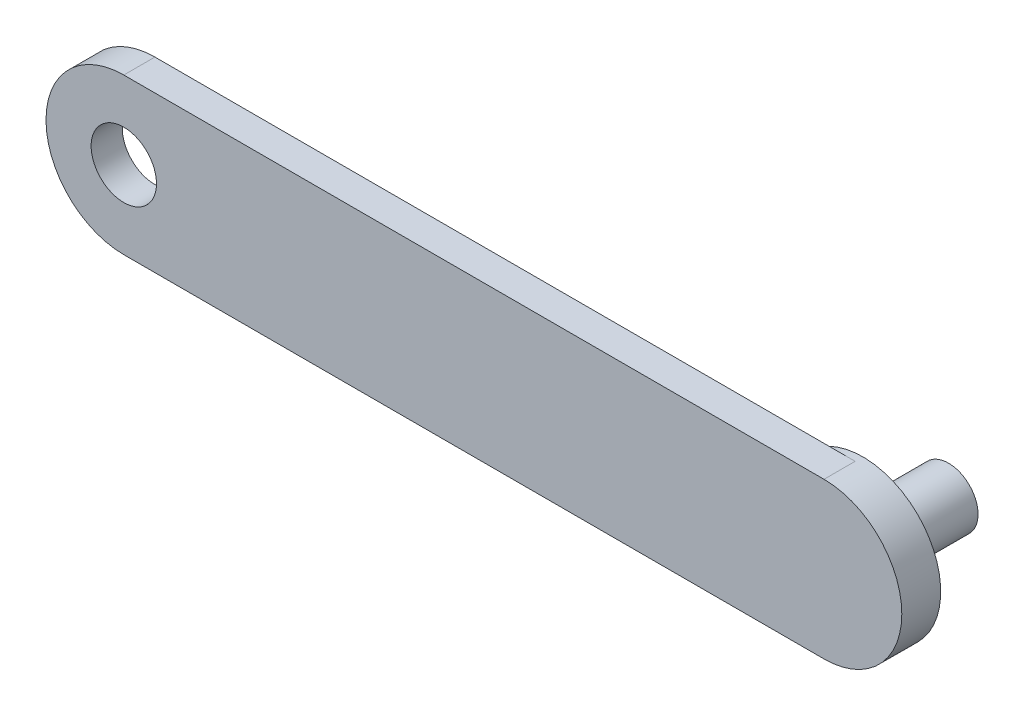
ISO-10303-21;
HEADER;
FILE_DESCRIPTION(('STEP AP214'),'2;1');
FILE_NAME('part.step','',(''),(''),'','','');
FILE_SCHEMA(('AUTOMOTIVE_DESIGN { 1 0 10303 214 1 1 1 1 }'));
ENDSEC;
DATA;
#1=APPLICATION_CONTEXT('core data for automotive mechanical design processes');
#2=APPLICATION_PROTOCOL_DEFINITION('international standard','automotive_design',2000,#1);
#3=PRODUCT_CONTEXT('',#1,'mechanical');
#4=PRODUCT('Part','Part','',(#3));
#5=PRODUCT_RELATED_PRODUCT_CATEGORY('part','',(#4));
#6=PRODUCT_DEFINITION_FORMATION('','',#4);
#7=PRODUCT_DEFINITION_CONTEXT('part definition',#1,'design');
#8=PRODUCT_DEFINITION('design','',#6,#7);
#9=PRODUCT_DEFINITION_SHAPE('','',#8);
#10=(LENGTH_UNIT() NAMED_UNIT(*) SI_UNIT(.MILLI.,.METRE.));
#11=(NAMED_UNIT(*) PLANE_ANGLE_UNIT() SI_UNIT($,.RADIAN.));
#12=(NAMED_UNIT(*) SI_UNIT($,.STERADIAN.) SOLID_ANGLE_UNIT());
#13=UNCERTAINTY_MEASURE_WITH_UNIT(LENGTH_MEASURE(1.E-05),#10,'distance_accuracy_value','');
#14=(GEOMETRIC_REPRESENTATION_CONTEXT(3) GLOBAL_UNCERTAINTY_ASSIGNED_CONTEXT((#13)) GLOBAL_UNIT_ASSIGNED_CONTEXT((#10,
#11,#12)) REPRESENTATION_CONTEXT('',''));
#15=CARTESIAN_POINT('',(0.,0.,0.));
#16=DIRECTION('',(0.,0.,1.));
#17=DIRECTION('',(1.,0.,0.));
#18=AXIS2_PLACEMENT_3D('',#15,#16,#17);
#19=CARTESIAN_POINT('',(0.,0.,0.));
#20=DIRECTION('',(0.,0.,1.));
#21=DIRECTION('',(1.,0.,0.));
#22=AXIS2_PLACEMENT_3D('',#19,#20,#21);
#23=PLANE('',#22);
#24=CARTESIAN_POINT('',(0.,0.,0.));
#25=DIRECTION('',(0.,0.,1.));
#26=DIRECTION('',(1.,0.,0.));
#27=AXIS2_PLACEMENT_3D('',#24,#25,#26);
#28=CIRCLE('',#27,2.1);
#29=CARTESIAN_POINT('',(2.1,0.,0.));
#30=VERTEX_POINT('',#29);
#31=EDGE_CURVE('E110',#30,#30,#28,.T.);
#32=ORIENTED_EDGE('',*,*,#31,.T.);
#33=EDGE_LOOP('',(#32));
#34=FACE_BOUND('',#33,.T.);
#35=CARTESIAN_POINT('',(45.,0.,0.));
#36=DIRECTION('',(0.,0.,-1.));
#37=DIRECTION('',(-1.,0.,0.));
#38=AXIS2_PLACEMENT_3D('',#35,#36,#37);
#39=CIRCLE('',#38,4.99999999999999);
#40=CARTESIAN_POINT('',(45.,-4.99999999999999,0.));
#41=VERTEX_POINT('',#40);
#42=CARTESIAN_POINT('',(45.,5.,0.));
#43=VERTEX_POINT('',#42);
#44=EDGE_CURVE('E66',#41,#43,#39,.T.);
#45=ORIENTED_EDGE('',*,*,#44,.F.);
#46=DIRECTION('',(1.,0.,0.));
#47=VECTOR('',#46,1.);
#48=CARTESIAN_POINT('',(0.,-5.,0.));
#49=LINE('',#48,#47);
#50=CARTESIAN_POINT('',(0.,-5.,0.));
#51=VERTEX_POINT('',#50);
#52=EDGE_CURVE('E84',#51,#41,#49,.T.);
#53=ORIENTED_EDGE('',*,*,#52,.F.);
#54=CARTESIAN_POINT('',(0.,0.,0.));
#55=DIRECTION('',(0.,0.,1.));
#56=DIRECTION('',(1.,0.,0.));
#57=AXIS2_PLACEMENT_3D('',#54,#55,#56);
#58=CIRCLE('',#57,5.);
#59=CARTESIAN_POINT('',(0.,5.,0.));
#60=VERTEX_POINT('',#59);
#61=EDGE_CURVE('E92',#60,#51,#58,.T.);
#62=ORIENTED_EDGE('',*,*,#61,.F.);
#63=DIRECTION('',(-1.,0.,0.));
#64=VECTOR('',#63,1.);
#65=CARTESIAN_POINT('',(0.,5.,0.));
#66=LINE('',#65,#64);
#67=EDGE_CURVE('E72',#43,#60,#66,.T.);
#68=ORIENTED_EDGE('',*,*,#67,.F.);
#69=EDGE_LOOP('',(#45,#53,#62,#68));
#70=FACE_BOUND('',#69,.T.);
#71=ADVANCED_FACE('F34',(#34,#70),#23,.F.);
#72=CARTESIAN_POINT('',(0.,0.,2.));
#73=DIRECTION('',(0.,0.,1.));
#74=DIRECTION('',(1.,0.,0.));
#75=AXIS2_PLACEMENT_3D('',#72,#73,#74);
#76=PLANE('',#75);
#77=CARTESIAN_POINT('',(0.,0.,2.));
#78=DIRECTION('',(0.,0.,1.));
#79=DIRECTION('',(1.,0.,0.));
#80=AXIS2_PLACEMENT_3D('',#77,#78,#79);
#81=CIRCLE('',#80,5.);
#82=CARTESIAN_POINT('',(0.,5.,2.));
#83=VERTEX_POINT('',#82);
#84=CARTESIAN_POINT('',(0.,-5.,2.));
#85=VERTEX_POINT('',#84);
#86=EDGE_CURVE('E102',#83,#85,#81,.T.);
#87=ORIENTED_EDGE('',*,*,#86,.T.);
#88=DIRECTION('',(1.,0.,0.));
#89=VECTOR('',#88,1.);
#90=CARTESIAN_POINT('',(0.,-5.,2.));
#91=LINE('',#90,#89);
#92=CARTESIAN_POINT('',(45.,-5.,2.));
#93=VERTEX_POINT('',#92);
#94=EDGE_CURVE('E79',#85,#93,#91,.T.);
#95=ORIENTED_EDGE('',*,*,#94,.T.);
#96=CARTESIAN_POINT('',(45.,0.,2.));
#97=DIRECTION('',(0.,0.,1.));
#98=DIRECTION('',(1.,0.,0.));
#99=AXIS2_PLACEMENT_3D('',#96,#97,#98);
#100=CIRCLE('',#99,5.);
#101=CARTESIAN_POINT('',(45.,5.,2.));
#102=VERTEX_POINT('',#101);
#103=EDGE_CURVE('E96',#93,#102,#100,.T.);
#104=ORIENTED_EDGE('',*,*,#103,.T.);
#105=DIRECTION('',(-1.,0.,0.));
#106=VECTOR('',#105,1.);
#107=CARTESIAN_POINT('',(0.,5.,2.));
#108=LINE('',#107,#106);
#109=EDGE_CURVE('E51',#102,#83,#108,.T.);
#110=ORIENTED_EDGE('',*,*,#109,.T.);
#111=EDGE_LOOP('',(#87,#95,#104,#110));
#112=FACE_BOUND('',#111,.T.);
#113=CARTESIAN_POINT('',(0.,0.,2.));
#114=DIRECTION('',(0.,0.,1.));
#115=DIRECTION('',(1.,0.,0.));
#116=AXIS2_PLACEMENT_3D('',#113,#114,#115);
#117=CIRCLE('',#116,2.1);
#118=CARTESIAN_POINT('',(2.1,0.,2.));
#119=VERTEX_POINT('',#118);
#120=EDGE_CURVE('E105',#119,#119,#117,.T.);
#121=ORIENTED_EDGE('',*,*,#120,.F.);
#122=EDGE_LOOP('',(#121));
#123=FACE_BOUND('',#122,.T.);
#124=ADVANCED_FACE('F142',(#112,#123),#76,.T.);
#125=CARTESIAN_POINT('',(0.,0.,2.));
#126=DIRECTION('',(0.,0.,-1.));
#127=DIRECTION('',(-1.,0.,0.));
#128=AXIS2_PLACEMENT_3D('',#125,#126,#127);
#129=CYLINDRICAL_SURFACE('',#128,5.);
#130=ORIENTED_EDGE('',*,*,#61,.T.);
#131=DIRECTION('',(0.,0.,-1.));
#132=VECTOR('',#131,1.);
#133=CARTESIAN_POINT('',(0.,-5.,2.));
#134=LINE('',#133,#132);
#135=EDGE_CURVE('E11',#85,#51,#134,.T.);
#136=ORIENTED_EDGE('',*,*,#135,.F.);
#137=ORIENTED_EDGE('',*,*,#86,.F.);
#138=DIRECTION('',(0.,0.,-1.));
#139=VECTOR('',#138,1.);
#140=CARTESIAN_POINT('',(0.,5.,2.));
#141=LINE('',#140,#139);
#142=EDGE_CURVE('E98',#83,#60,#141,.T.);
#143=ORIENTED_EDGE('',*,*,#142,.T.);
#144=EDGE_LOOP('',(#130,#136,#137,#143));
#145=FACE_BOUND('',#144,.T.);
#146=ADVANCED_FACE('F36',(#145),#129,.T.);
#147=CARTESIAN_POINT('',(0.,-5.,2.));
#148=DIRECTION('',(0.,1.,0.));
#149=DIRECTION('',(0.,0.,1.));
#150=AXIS2_PLACEMENT_3D('',#147,#148,#149);
#151=PLANE('',#150);
#152=ORIENTED_EDGE('',*,*,#52,.T.);
#153=DIRECTION('',(0.,0.,-1.));
#154=VECTOR('',#153,1.);
#155=CARTESIAN_POINT('',(45.,-5.,2.));
#156=LINE('',#155,#154);
#157=EDGE_CURVE('E43',#93,#41,#156,.T.);
#158=ORIENTED_EDGE('',*,*,#157,.F.);
#159=ORIENTED_EDGE('',*,*,#94,.F.);
#160=ORIENTED_EDGE('',*,*,#135,.T.);
#161=EDGE_LOOP('',(#152,#158,#159,#160));
#162=FACE_BOUND('',#161,.T.);
#163=ADVANCED_FACE('F88',(#162),#151,.F.);
#164=CARTESIAN_POINT('',(45.,0.,2.));
#165=DIRECTION('',(0.,0.,-1.));
#166=DIRECTION('',(-1.,0.,0.));
#167=AXIS2_PLACEMENT_3D('',#164,#165,#166);
#168=CYLINDRICAL_SURFACE('',#167,5.);
#169=ORIENTED_EDGE('',*,*,#157,.T.);
#170=ORIENTED_EDGE('',*,*,#44,.T.);
#171=DIRECTION('',(0.,0.,-1.));
#172=VECTOR('',#171,1.);
#173=CARTESIAN_POINT('',(45.,5.,2.));
#174=LINE('',#173,#172);
#175=EDGE_CURVE('E97',#102,#43,#174,.T.);
#176=ORIENTED_EDGE('',*,*,#175,.F.);
#177=ORIENTED_EDGE('',*,*,#103,.F.);
#178=EDGE_LOOP('',(#169,#170,#176,#177));
#179=FACE_BOUND('',#178,.T.);
#180=CARTESIAN_POINT('',(45.,0.,-0.5));
#181=DIRECTION('',(0.,0.,-1.));
#182=DIRECTION('',(-1.,0.,0.));
#183=AXIS2_PLACEMENT_3D('',#180,#181,#182);
#184=CIRCLE('',#183,4.99999999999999);
#185=CARTESIAN_POINT('',(40.,0.,-0.5));
#186=VERTEX_POINT('',#185);
#187=EDGE_CURVE('E85',#186,#186,#184,.T.);
#188=ORIENTED_EDGE('',*,*,#187,.F.);
#189=EDGE_LOOP('',(#188));
#190=FACE_BOUND('',#189,.T.);
#191=ADVANCED_FACE('F94',(#179,#190),#168,.T.);
#192=CARTESIAN_POINT('',(0.,5.,2.));
#193=DIRECTION('',(0.,-1.,0.));
#194=DIRECTION('',(0.,0.,-1.));
#195=AXIS2_PLACEMENT_3D('',#192,#193,#194);
#196=PLANE('',#195);
#197=ORIENTED_EDGE('',*,*,#67,.T.);
#198=ORIENTED_EDGE('',*,*,#142,.F.);
#199=ORIENTED_EDGE('',*,*,#109,.F.);
#200=ORIENTED_EDGE('',*,*,#175,.T.);
#201=EDGE_LOOP('',(#197,#198,#199,#200));
#202=FACE_BOUND('',#201,.T.);
#203=ADVANCED_FACE('F138',(#202),#196,.F.);
#204=CARTESIAN_POINT('',(0.,0.,2.));
#205=DIRECTION('',(0.,0.,-1.));
#206=DIRECTION('',(-1.,0.,0.));
#207=AXIS2_PLACEMENT_3D('',#204,#205,#206);
#208=CYLINDRICAL_SURFACE('',#207,2.1);
#209=ORIENTED_EDGE('',*,*,#120,.T.);
#210=EDGE_LOOP('',(#209));
#211=FACE_BOUND('',#210,.T.);
#212=ORIENTED_EDGE('',*,*,#31,.F.);
#213=EDGE_LOOP('',(#212));
#214=FACE_BOUND('',#213,.T.);
#215=ADVANCED_FACE('F129',(#211,#214),#208,.F.);
#216=CARTESIAN_POINT('',(45.,0.,-0.5));
#217=DIRECTION('',(0.,0.,-1.));
#218=DIRECTION('',(-1.,0.,0.));
#219=AXIS2_PLACEMENT_3D('',#216,#217,#218);
#220=PLANE('',#219);
#221=ORIENTED_EDGE('',*,*,#187,.T.);
#222=EDGE_LOOP('',(#221));
#223=FACE_BOUND('',#222,.T.);
#224=CARTESIAN_POINT('',(45.,0.,-0.5));
#225=DIRECTION('',(0.,0.,-1.));
#226=DIRECTION('',(-1.,0.,0.));
#227=AXIS2_PLACEMENT_3D('',#224,#225,#226);
#228=CIRCLE('',#227,1.9);
#229=CARTESIAN_POINT('',(43.1,0.,-0.5));
#230=VERTEX_POINT('',#229);
#231=EDGE_CURVE('E86',#230,#230,#228,.T.);
#232=ORIENTED_EDGE('',*,*,#231,.F.);
#233=EDGE_LOOP('',(#232));
#234=FACE_BOUND('',#233,.T.);
#235=ADVANCED_FACE('F126',(#223,#234),#220,.T.);
#236=CARTESIAN_POINT('',(45.,0.,-6.));
#237=DIRECTION('',(0.,0.,-1.));
#238=DIRECTION('',(-1.,0.,0.));
#239=AXIS2_PLACEMENT_3D('',#236,#237,#238);
#240=PLANE('',#239);
#241=CARTESIAN_POINT('',(45.,0.,-6.));
#242=DIRECTION('',(0.,0.,-1.));
#243=DIRECTION('',(-1.,0.,0.));
#244=AXIS2_PLACEMENT_3D('',#241,#242,#243);
#245=CIRCLE('',#244,1.9);
#246=CARTESIAN_POINT('',(43.1,0.,-6.));
#247=VERTEX_POINT('',#246);
#248=EDGE_CURVE('E113',#247,#247,#245,.T.);
#249=ORIENTED_EDGE('',*,*,#248,.T.);
#250=EDGE_LOOP('',(#249));
#251=FACE_BOUND('',#250,.T.);
#252=ADVANCED_FACE('F128',(#251),#240,.T.);
#253=CARTESIAN_POINT('',(45.,0.,-6.));
#254=DIRECTION('',(0.,0.,1.));
#255=DIRECTION('',(1.,0.,0.));
#256=AXIS2_PLACEMENT_3D('',#253,#254,#255);
#257=CYLINDRICAL_SURFACE('',#256,1.9);
#258=ORIENTED_EDGE('',*,*,#231,.T.);
#259=EDGE_LOOP('',(#258));
#260=FACE_BOUND('',#259,.T.);
#261=ORIENTED_EDGE('',*,*,#248,.F.);
#262=EDGE_LOOP('',(#261));
#263=FACE_BOUND('',#262,.T.);
#264=ADVANCED_FACE('F123',(#260,#263),#257,.T.);
#265=CLOSED_SHELL('',(#71,#124,#146,#163,#191,#203,#215,#235,#252,#264));
#266=MANIFOLD_SOLID_BREP('B2',#265);
#267=ADVANCED_BREP_SHAPE_REPRESENTATION('',(#18,#266),#14);
#268=SHAPE_DEFINITION_REPRESENTATION(#9,#267);
ENDSEC;
END-ISO-10303-21;
